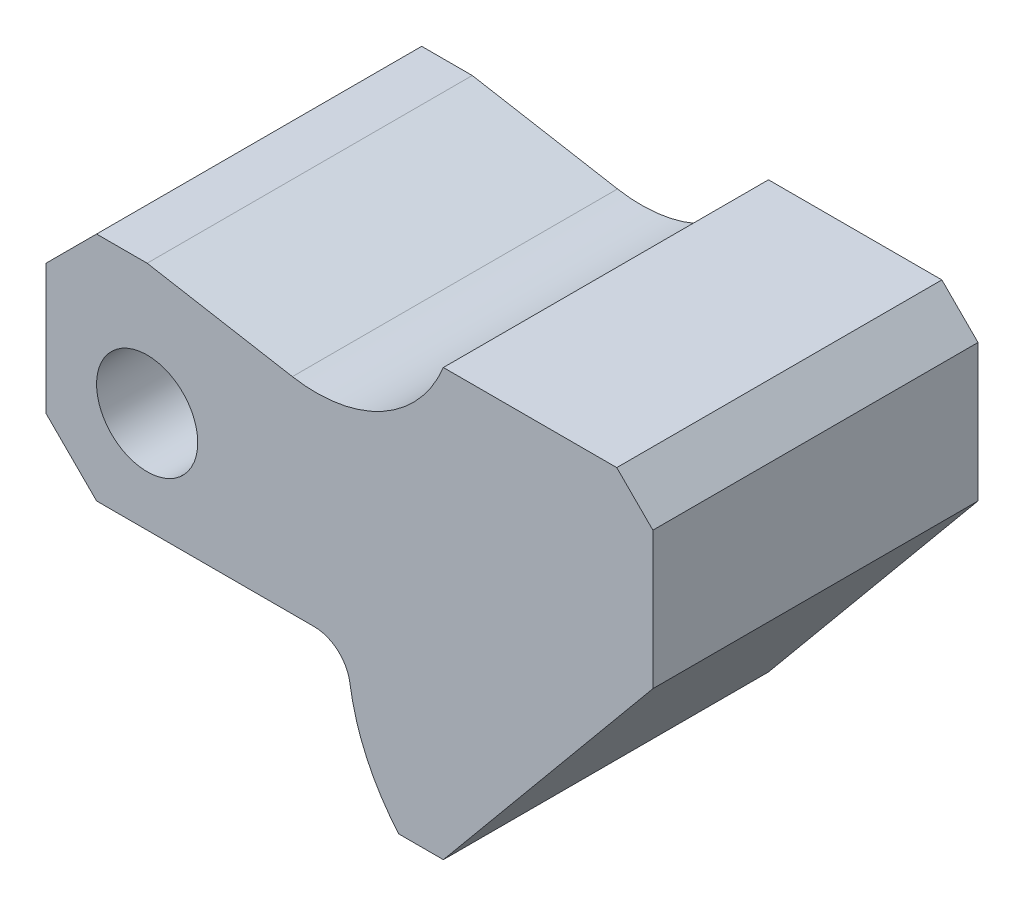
from build123d import *

# Parameters (mm, degrees)
BOSS_EXTRUDE1_DEPTH = 22.5
CHAMFER1_SIZE       = 7
CHAMFER2_SIZE       = 5
SKETCH2_R           = 7
CUT_EXTRUDE1_DEPTH  = 104.348923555


with BuildPart() as part:
    # Sketch1 → Boss-Extrude1 (new, symmetric)
    with BuildSketch(Plane.XY):
        with BuildLine():
            Line((0, 0), (0, 32))
            Line((0, 32), (14, 32))
            Line((14, 32), (34.104042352, 28.455114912))
            ThreePointArc((34.104042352, 28.455114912), (46.591637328, 30.535902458), (55, 40))
            Line((55, 40), (84, 40))
            Line((84, 40), (84, 16))
            Line((84, 16), (55, -19))
            Line((55, -19), (48.833954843, -19))
            ThreePointArc((48.833954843, -19), (44.394982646, -12.115672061), (42.058152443, -4.264705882))
            ThreePointArc((42.058152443, -4.264705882), (40.377749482, -1.213413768), (37.112513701, 0))
            Line((37.112513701, 0), (0, 0))
        make_face()
    extrude(amount=BOSS_EXTRUDE1_DEPTH, both=True)

    # Chamfer1
    chamfer1_edges = [part.edges().sort_by_distance(p)[0] for p in [
        (0, 0, 0),
        (0, 32, 0),
    ]]
    chamfer(chamfer1_edges, length=CHAMFER1_SIZE)

    # Chamfer2
    chamfer2_edges = [part.edges().sort_by_distance(p)[0] for p in [
        (84, 40, 0),
    ]]
    chamfer(chamfer2_edges, length=CHAMFER2_SIZE)

    # Sketch2 → Cut-Extrude1 (cut, through all)
    with BuildSketch(Plane.XY.offset(22.5)):
        with Locations((14, 14)):
            Circle(SKETCH2_R)
    extrude(amount=-CUT_EXTRUDE1_DEPTH, mode=Mode.SUBTRACT)


solid = part.part
